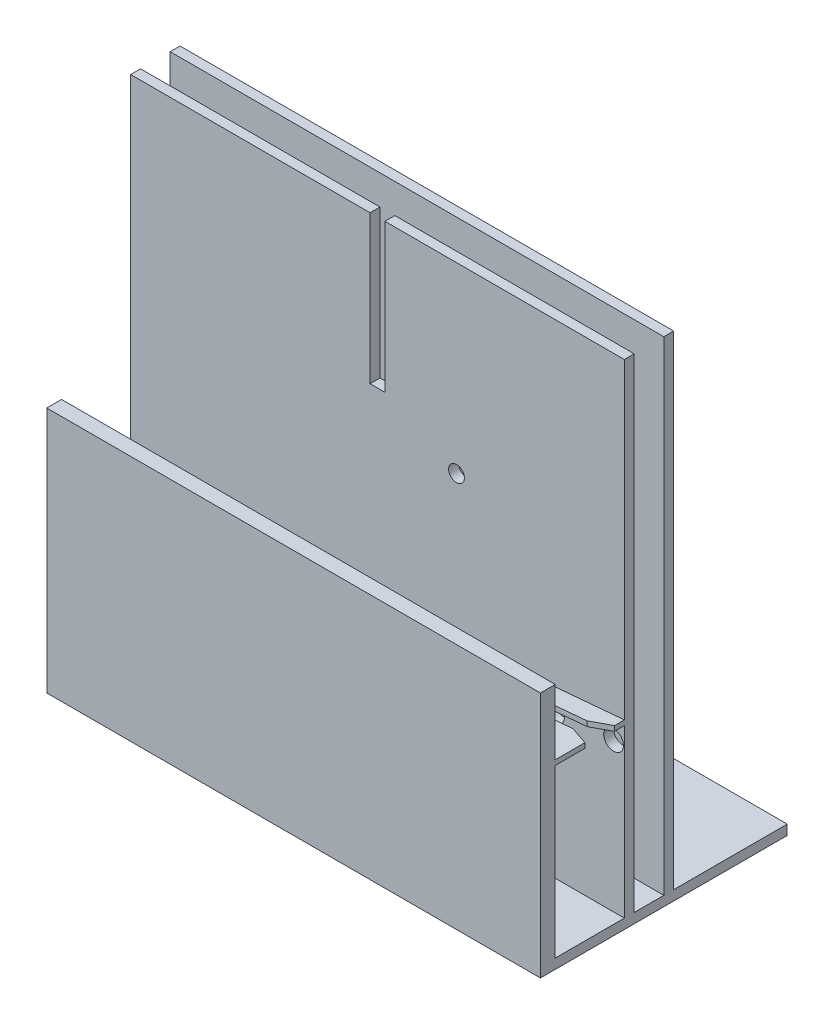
from build123d import *

# Parameters (mm, degrees)
SKETCH_MACHINE_CASE_W                      = 500
SKETCH_MACHINE_CASE_H                      = 250
MACHINE_CASE_DEPTH                         = 500
CUT_SHELL_START                            = 10
SKETCH_SHELL_W                             = 500
SKETCH_SHELL_H                             = 110
SKETCH_SHELL_H_2                           = 115
CUT_SHELL_DEPTH                            = 563.821961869
CUT_CAM_SHAFT_REACH                        = 574.822
SKETCH_CAM_SHAFT_R                         = 15
SKETCH_NUZZLE_FIXTURE_W                    = 500
SKETCH_NUZZLE_FIXTURE_H                    = 490
NUZZLE_FIXTURE_DEPTH                       = 10
SQUEEZING_SLOT_REACH                       = 584.859
SKETCH_SQUEEZING_SLOT_W                    = 15
SKETCH_SQUEEZING_SLOT_H                    = 150
CUT_CASE_TRIM_REACH                        = 614.372
SKETCH_CASE_TRIM_W                         = 500
SKETCH_CASE_TRIM_H                         = 250
CUT_ROLLING_WHEEL_SHAFT_HOLE_INSIDE_REACH  = 584.859
SKETCH_ROLLING_WHEEL_SHAFT_HOLE_INSIDE_R   = 10
CUT_ROLLING_START                          = -10
SKETCH_ROLLING_WHEEL_SHAFT_HOLE_OUTSIDE_R  = 10
CUT_ROLLING_WHEEL_SHAFT_HOLE_OUTSIDE_DEPTH = 10
LPATTERN_CONVEYOR_SLANT_COUNT              = 5
LPATTERN_CONVEYOR_SLANT_PITCH              = 60
LPATTERN_CONVEYOR_FLAT_COUNT               = 5
LPATTERN_CONVEYOR_FLAT_PITCH               = 55
POSITIONING_NOTCH_REACH                    = 584.859
CUT_NOTCH_REACH                            = 449.671
CUT_TOOTHPASTE_PATH_HOLD_REACH             = 574.822
SKETCH_TOOTHPASTE_PATH_HOLD_R              = 8
CUT_TOOTHPASTE_PATH_HOLD_DIRECTION_2_REACH = 574.822


with BuildPart() as part:
    # Sketch_Machine Case → Machine Case (new body)
    with BuildSketch(Plane(origin=(0, 0, 0), x_dir=(1, 0, 0), z_dir=(0, 1, 0))):
        Rectangle(SKETCH_MACHINE_CASE_W, SKETCH_MACHINE_CASE_H)
    extrude(amount=MACHINE_CASE_DEPTH)

    # Sketch_Shell → Cut_Shell (cut, through all)
    with BuildSketch(Plane(origin=(0, 0, 0), x_dir=(1, 0, 0), z_dir=(0, 1, 0)).offset(CUT_SHELL_START)):
        with Locations((0, -55)):
            Rectangle(SKETCH_SHELL_W, SKETCH_SHELL_H)
        with Locations((0, 67.5)):
            Rectangle(SKETCH_SHELL_W, SKETCH_SHELL_H_2)
    extrude(amount=CUT_SHELL_DEPTH, mode=Mode.SUBTRACT)

    # Sketch_Cam Shaft → Cut_Cam Shaft (cut, up to next)
    with BuildSketch(Plane.XY, mode=Mode.PRIVATE) as cut_cam_shaft_sk1:
        with Locations((0, 315)):
            Circle(SKETCH_CAM_SHAFT_R)
    cut_cam_shaft_tool1 = extrude(cut_cam_shaft_sk1.sketch, amount=-CUT_CAM_SHAFT_REACH, mode=Mode.PRIVATE) & part.part
    add(cut_cam_shaft_tool1.solids().sort_by_distance((0, 315, 0))[0], mode=Mode.SUBTRACT)

    # Sketch_Nuzzle Fixture → Nuzzle Fixture (add)
    with BuildSketch(Plane.XY.offset(40)):
        with Locations((0, 255)):
            Rectangle(SKETCH_NUZZLE_FIXTURE_W, SKETCH_NUZZLE_FIXTURE_H)
    extrude(amount=-NUZZLE_FIXTURE_DEPTH)

    # Sketch_Squeezing Slot → Squeezing Slot (cut, up to next)
    with BuildSketch(Plane.XY.offset(40), mode=Mode.PRIVATE) as squeezing_slot_sk1:
        with Locations((0, 425)):
            Rectangle(SKETCH_SQUEEZING_SLOT_W, SKETCH_SQUEEZING_SLOT_H)
    squeezing_slot_tool1 = extrude(squeezing_slot_sk1.sketch, amount=-SQUEEZING_SLOT_REACH, mode=Mode.PRIVATE) & part.part
    add(squeezing_slot_tool1.solids().sort_by_distance((0, 425, 40))[0], mode=Mode.SUBTRACT)

    # Sketch_Case Trim → Cut_Case Trim (cut, up to next)
    with BuildSketch(Plane.XY.offset(125), mode=Mode.PRIVATE) as cut_case_trim_sk1:
        with Locations((0, 375)):
            Rectangle(SKETCH_CASE_TRIM_W, SKETCH_CASE_TRIM_H)
    cut_case_trim_tool1 = extrude(cut_case_trim_sk1.sketch, amount=-CUT_CASE_TRIM_REACH, mode=Mode.PRIVATE) & part.part
    add(cut_case_trim_tool1.solids().sort_by_distance((0, 375, 125))[0], mode=Mode.SUBTRACT)

    # Sketch_Rolling Wheel Shaft Hole_Inside → Cut_Rolling Wheel Shaft Hole_Inside (cut, up to next)
    with BuildSketch(Plane.XY.offset(40), mode=Mode.PRIVATE) as cut_rolling_wheel_shaft_hole_inside_sk1:
        with Locations((0, 140)):
            Circle(SKETCH_ROLLING_WHEEL_SHAFT_HOLE_INSIDE_R)
    cut_rolling_wheel_shaft_hole_inside_tool1 = extrude(cut_rolling_wheel_shaft_hole_inside_sk1.sketch, amount=-CUT_ROLLING_WHEEL_SHAFT_HOLE_INSIDE_REACH, mode=Mode.PRIVATE) & part.part
    cut_rolling_wheel_shaft_hole_inside = cut_rolling_wheel_shaft_hole_inside_tool1.solids().sort_by_distance((0, 140, 40))[0]
    add(cut_rolling_wheel_shaft_hole_inside, mode=Mode.SUBTRACT)

    # Sketch_Rolling Wheel Shaft Hole_Outside → Cut_Rolling Wheel Shaft Hole_Outside (cut)
    with BuildSketch(Plane(origin=(0, 0, 110), x_dir=(-1, 0, 0), z_dir=(0, 0, -1)).offset(CUT_ROLLING_START)):
        with Locations(Location((0, 140, 0), (0, 0, 180))):
            Circle(SKETCH_ROLLING_WHEEL_SHAFT_HOLE_OUTSIDE_R)
    cut_rolling_wheel_shaft_hole_outside = extrude(amount=CUT_ROLLING_WHEEL_SHAFT_HOLE_OUTSIDE_DEPTH, mode=Mode.SUBTRACT)

    # LPattern_Conveyor Slant: Cut_Rolling Wheel Shaft Hole_Inside, Cut_Rolling Wheel Shaft Hole_Outside ×5
    with Locations(*[Vector(0.9961946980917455, 0.08715574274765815, 0) * (i * LPATTERN_CONVEYOR_SLANT_PITCH) for i in range(1, LPATTERN_CONVEYOR_SLANT_COUNT)]):
        add(cut_rolling_wheel_shaft_hole_inside, mode=Mode.SUBTRACT)
        add(cut_rolling_wheel_shaft_hole_outside, mode=Mode.SUBTRACT)

    # LPattern_Conveyor Flat: Cut_Rolling Wheel Shaft Hole_Inside, Cut_Rolling Wheel Shaft Hole_Outside ×5
    with Locations(*[(-i * LPATTERN_CONVEYOR_FLAT_PITCH, 0, 0) for i in range(1, LPATTERN_CONVEYOR_FLAT_COUNT)]):
        add(cut_rolling_wheel_shaft_hole_inside, mode=Mode.SUBTRACT)
        add(cut_rolling_wheel_shaft_hole_outside, mode=Mode.SUBTRACT)

    # Sketch_Positioning Notch → Positioning Notch (add, up to next)
    with BuildSketch(Plane.XY.offset(40), mode=Mode.PRIVATE) as positioning_notch_sk1:
        Polygon((250, 178.910364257), (-0.436609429, 157), (-0.436609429, 162), (250, 183.910364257), align=None)
    positioning_notch_tool1 = extrude(positioning_notch_sk1.sketch, amount=POSITIONING_NOTCH_REACH, mode=Mode.PRIVATE) - part.part
    add(positioning_notch_tool1.solids().sort_by_distance((124.781695, 170.455182, 40))[0])

    # Sketch_Notch → Cut_Notch (cut, up to next)
    with BuildSketch(Plane(origin=(-14.06881893, 160.80733621, 0), x_dir=(0.9961946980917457, 0.08715574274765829, 0), z_dir=(-0.08715574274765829, 0.9961946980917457, 0)), mode=Mode.PRIVATE) as cut_notch_sk1:
        Polygon((13.684282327, -58), (245.077518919, -58), (265.077518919, -50), (265.077518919, -80), (245.077518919, -72), (13.684282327, -72), align=None)
    cut_notch_tool1 = extrude(cut_notch_sk1.sketch, amount=-CUT_NOTCH_REACH, mode=Mode.PRIVATE) & part.part
    add(cut_notch_tool1.solids().sort_by_distance((129.93791, 173.406293, 65))[0], mode=Mode.SUBTRACT)

    # Sketch_Toothpaste Path Hold → Cut_Toothpaste Path Hold (cut, up to next)
    with BuildSketch(Plane.XY, mode=Mode.PRIVATE) as cut_toothpaste_path_hold_sk1:
        with Locations((80, 315)):
            Circle(SKETCH_TOOTHPASTE_PATH_HOLD_R)
    cut_toothpaste_path_hold_tool1 = extrude(cut_toothpaste_path_hold_sk1.sketch, amount=-CUT_TOOTHPASTE_PATH_HOLD_REACH, mode=Mode.PRIVATE) & part.part
    add(cut_toothpaste_path_hold_tool1.solids().sort_by_distance((80, 315, 0))[0], mode=Mode.SUBTRACT)

    # Cut_Toothpaste Path Hold direction 2: up to this face of the body (flat: up to its plane)
    cut_toothpaste_path_hold_direction_2_end = Plane(part.part.faces().sort_by_distance((-0.717475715, 255.134461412, 40))[0])
    # Sketch_Toothpaste Path Hold → Cut_Toothpaste Path Hold direction 2 (cut, up to the picked face)
    with BuildSketch(Plane.XY, mode=Mode.PRIVATE) as cut_toothpaste_path_hold_direction_2_sk1:
        with Locations((80, 315)):
            Circle(SKETCH_TOOTHPASTE_PATH_HOLD_R)
    cut_toothpaste_path_hold_direction_2_tool1 = split(extrude(cut_toothpaste_path_hold_direction_2_sk1.sketch, amount=CUT_TOOTHPASTE_PATH_HOLD_DIRECTION_2_REACH, mode=Mode.PRIVATE), bisect_by=cut_toothpaste_path_hold_direction_2_end, keep=Keep.BOTH, mode=Mode.PRIVATE)
    add(cut_toothpaste_path_hold_direction_2_tool1.solids().sort_by(Axis((80, 315, 0), (0, 0, 1)))[0], mode=Mode.SUBTRACT)


solid = part.part
